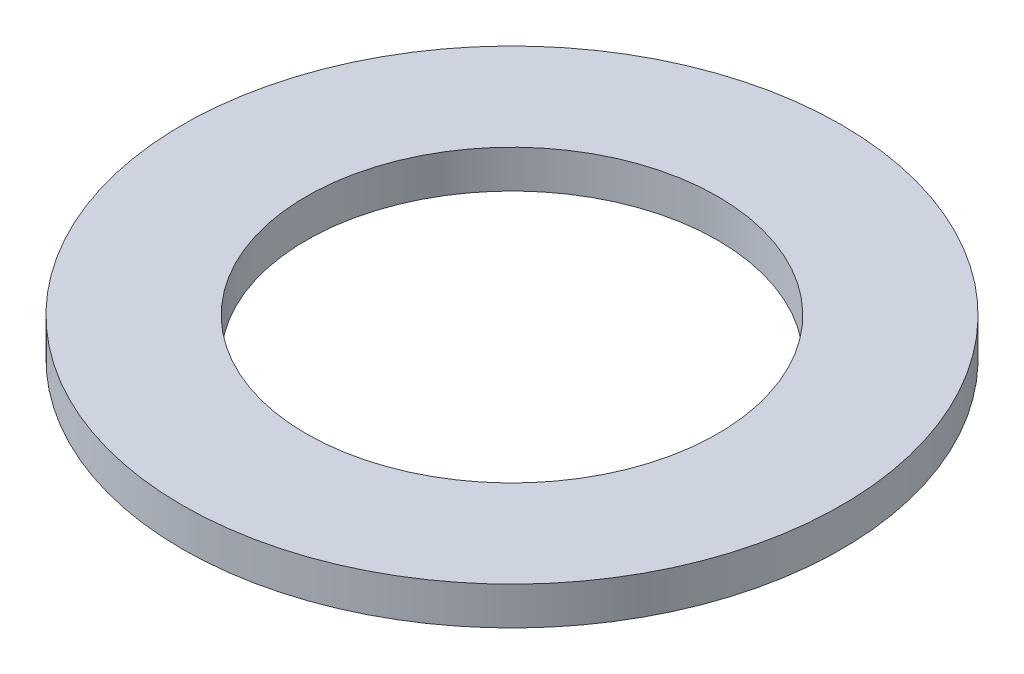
from build123d import *

# Parameters (mm, degrees)
SKETCH1_R           = 7.9375
BOSS_EXTRUDE1_DEPTH = 0.9144
SKETCH5_R           = 4.953
CUT_EXTRUDE1_DEPTH  = 12.262501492


with BuildPart() as part:
    # Sketch1 → Boss-Extrude1 (new body)
    with BuildSketch(Plane(origin=(0, 0, 0), x_dir=(1, 0, 0), z_dir=(0, 1, 0))):
        with Locations(Location((0, 0, 0), (0, 0, 270))):
            Circle(SKETCH1_R)
    extrude(amount=BOSS_EXTRUDE1_DEPTH)

    # Sketch5 → Cut-Extrude1 (cut, through all)
    with BuildSketch(Plane(origin=(0, 0.9144, 0), x_dir=(-1, 0, 0), z_dir=(0, 1, 0))):
        with Locations(Location((0, 0, 0), (0, 0, 90))):
            Circle(SKETCH5_R)
    extrude(amount=-CUT_EXTRUDE1_DEPTH, mode=Mode.SUBTRACT)


solid = part.part
